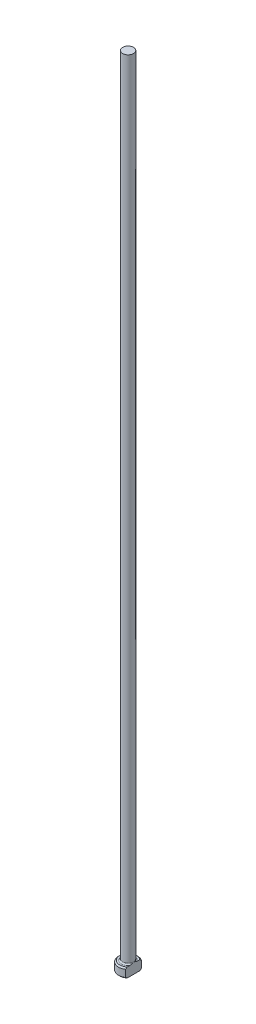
ISO-10303-21;
HEADER;
FILE_DESCRIPTION(('STEP AP214'),'2;1');
FILE_NAME('part.step','',(''),(''),'','','');
FILE_SCHEMA(('AUTOMOTIVE_DESIGN { 1 0 10303 214 1 1 1 1 }'));
ENDSEC;
DATA;
#1=APPLICATION_CONTEXT('core data for automotive mechanical design processes');
#2=APPLICATION_PROTOCOL_DEFINITION('international standard','automotive_design',2000,#1);
#3=PRODUCT_CONTEXT('',#1,'mechanical');
#4=PRODUCT('Part','Part','',(#3));
#5=PRODUCT_RELATED_PRODUCT_CATEGORY('part','',(#4));
#6=PRODUCT_DEFINITION_FORMATION('','',#4);
#7=PRODUCT_DEFINITION_CONTEXT('part definition',#1,'design');
#8=PRODUCT_DEFINITION('design','',#6,#7);
#9=PRODUCT_DEFINITION_SHAPE('','',#8);
#10=(LENGTH_UNIT() NAMED_UNIT(*) SI_UNIT(.MILLI.,.METRE.));
#11=(NAMED_UNIT(*) PLANE_ANGLE_UNIT() SI_UNIT($,.RADIAN.));
#12=(NAMED_UNIT(*) SI_UNIT($,.STERADIAN.) SOLID_ANGLE_UNIT());
#13=UNCERTAINTY_MEASURE_WITH_UNIT(LENGTH_MEASURE(1.E-05),#10,'distance_accuracy_value','');
#14=(GEOMETRIC_REPRESENTATION_CONTEXT(3) GLOBAL_UNCERTAINTY_ASSIGNED_CONTEXT((#13)) GLOBAL_UNIT_ASSIGNED_CONTEXT((#10,
#11,#12)) REPRESENTATION_CONTEXT('',''));
#15=CARTESIAN_POINT('',(0.,0.,0.));
#16=DIRECTION('',(0.,0.,1.));
#17=DIRECTION('',(1.,0.,0.));
#18=AXIS2_PLACEMENT_3D('',#15,#16,#17);
#19=CARTESIAN_POINT('',(0.,0.,0.));
#20=DIRECTION('',(0.,-1.,0.));
#21=DIRECTION('',(0.,0.,-1.));
#22=AXIS2_PLACEMENT_3D('',#19,#20,#21);
#23=PLANE('',#22);
#24=CARTESIAN_POINT('',(0.,0.,0.));
#25=DIRECTION('',(0.,-1.,0.));
#26=DIRECTION('',(0.,0.,-1.));
#27=AXIS2_PLACEMENT_3D('',#24,#25,#26);
#28=CIRCLE('',#27,1.29999999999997);
#29=CARTESIAN_POINT('',(0.849999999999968,0.,0.983615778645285));
#30=VERTEX_POINT('',#29);
#31=CARTESIAN_POINT('',(0.849999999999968,0.,-0.983615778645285));
#32=VERTEX_POINT('',#31);
#33=EDGE_CURVE('E98',#30,#32,#28,.T.);
#34=ORIENTED_EDGE('',*,*,#33,.T.);
#35=DIRECTION('',(0.,0.,1.));
#36=VECTOR('',#35,1.);
#37=CARTESIAN_POINT('',(0.849999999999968,0.,-1.23592070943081));
#38=LINE('',#37,#36);
#39=EDGE_CURVE('E83',#32,#30,#38,.T.);
#40=ORIENTED_EDGE('',*,*,#39,.T.);
#41=EDGE_LOOP('',(#34,#40));
#42=FACE_BOUND('',#41,.T.);
#43=ADVANCED_FACE('F32',(#42),#23,.T.);
#44=CARTESIAN_POINT('',(0.,259.958771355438,0.));
#45=DIRECTION('',(0.,1.,0.));
#46=DIRECTION('',(0.,0.,1.));
#47=AXIS2_PLACEMENT_3D('',#44,#45,#46);
#48=CYLINDRICAL_SURFACE('',#47,1.49999999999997);
#49=CARTESIAN_POINT('',(0.,1.29999999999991,0.));
#50=DIRECTION('',(0.,1.,0.));
#51=DIRECTION('',(0.,0.,1.));
#52=AXIS2_PLACEMENT_3D('',#49,#50,#51);
#53=CIRCLE('',#52,1.49999999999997);
#54=CARTESIAN_POINT('',(0.849999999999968,1.29999999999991,1.23592070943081));
#55=VERTEX_POINT('',#54);
#56=CARTESIAN_POINT('',(0.849999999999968,1.29999999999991,-1.23592070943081));
#57=VERTEX_POINT('',#56);
#58=EDGE_CURVE('E104',#55,#57,#53,.F.);
#59=ORIENTED_EDGE('',*,*,#58,.T.);
#60=DIRECTION('',(0.,-1.,0.));
#61=VECTOR('',#60,1.);
#62=CARTESIAN_POINT('',(0.849999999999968,125.,-1.23592070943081));
#63=LINE('',#62,#61);
#64=CARTESIAN_POINT('',(0.849999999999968,0.200000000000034,-1.23592070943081));
#65=VERTEX_POINT('',#64);
#66=EDGE_CURVE('E183',#57,#65,#63,.T.);
#67=ORIENTED_EDGE('',*,*,#66,.T.);
#68=CARTESIAN_POINT('',(0.,0.200000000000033,0.));
#69=DIRECTION('',(0.,-1.,0.));
#70=DIRECTION('',(0.,0.,-1.));
#71=AXIS2_PLACEMENT_3D('',#68,#69,#70);
#72=CIRCLE('',#71,1.49999999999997);
#73=CARTESIAN_POINT('',(0.849999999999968,0.200000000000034,1.23592070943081));
#74=VERTEX_POINT('',#73);
#75=EDGE_CURVE('E100',#65,#74,#72,.F.);
#76=ORIENTED_EDGE('',*,*,#75,.T.);
#77=DIRECTION('',(0.,-1.,0.));
#78=VECTOR('',#77,1.);
#79=CARTESIAN_POINT('',(0.849999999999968,125.,1.23592070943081));
#80=LINE('',#79,#78);
#81=EDGE_CURVE('E93',#55,#74,#80,.T.);
#82=ORIENTED_EDGE('',*,*,#81,.F.);
#83=EDGE_LOOP('',(#59,#67,#76,#82));
#84=FACE_BOUND('',#83,.T.);
#85=ADVANCED_FACE('F158',(#84),#48,.T.);
#86=CARTESIAN_POINT('',(-1.49999999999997,1.5,0.));
#87=DIRECTION('',(0.,1.,0.));
#88=DIRECTION('',(0.,0.,1.));
#89=AXIS2_PLACEMENT_3D('',#86,#87,#88);
#90=PLANE('',#89);
#91=CARTESIAN_POINT('',(0.,1.5,0.));
#92=DIRECTION('',(0.,1.,0.));
#93=DIRECTION('',(0.,0.,1.));
#94=AXIS2_PLACEMENT_3D('',#91,#92,#93);
#95=CIRCLE('',#94,1.29999999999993);
#96=CARTESIAN_POINT('',(0.849999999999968,1.5,-0.983615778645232));
#97=VERTEX_POINT('',#96);
#98=CARTESIAN_POINT('',(0.849999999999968,1.5,0.983615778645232));
#99=VERTEX_POINT('',#98);
#100=EDGE_CURVE('E178',#97,#99,#95,.T.);
#101=ORIENTED_EDGE('',*,*,#100,.T.);
#102=DIRECTION('',(0.,0.,-1.));
#103=VECTOR('',#102,1.);
#104=CARTESIAN_POINT('',(0.849999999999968,1.5,0.));
#105=LINE('',#104,#103);
#106=CARTESIAN_POINT('',(0.849999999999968,1.49999999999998,0.616441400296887));
#107=VERTEX_POINT('',#106);
#108=EDGE_CURVE('E57',#99,#107,#105,.T.);
#109=ORIENTED_EDGE('',*,*,#108,.T.);
#110=CARTESIAN_POINT('',(0.,1.5,0.));
#111=DIRECTION('',(0.,1.,0.));
#112=DIRECTION('',(0.,0.,1.));
#113=AXIS2_PLACEMENT_3D('',#110,#111,#112);
#114=CIRCLE('',#113,1.04999999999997);
#115=CARTESIAN_POINT('',(0.849999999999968,1.49999999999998,-0.616441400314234));
#116=VERTEX_POINT('',#115);
#117=EDGE_CURVE('E107',#107,#116,#114,.F.);
#118=ORIENTED_EDGE('',*,*,#117,.T.);
#119=EDGE_CURVE('E136',#116,#97,#105,.T.);
#120=ORIENTED_EDGE('',*,*,#119,.T.);
#121=EDGE_LOOP('',(#101,#109,#118,#120));
#122=FACE_BOUND('',#121,.T.);
#123=ADVANCED_FACE('F147',(#122),#90,.T.);
#124=CARTESIAN_POINT('',(0.,1.5,0.));
#125=DIRECTION('',(0.,-1.,0.));
#126=DIRECTION('',(0.,0.,-1.));
#127=AXIS2_PLACEMENT_3D('',#124,#125,#126);
#128=CONICAL_SURFACE('',#127,1.29999999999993,0.785398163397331);
#129=ORIENTED_EDGE('',*,*,#58,.F.);
#130=CARTESIAN_POINT('',(0.849999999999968,-0.0536064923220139,2.72407232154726));
#131=CARTESIAN_POINT('',(0.849999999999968,0.0399148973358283,2.62606654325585));
#132=CARTESIAN_POINT('',(0.849999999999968,0.133238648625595,2.52786853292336));
#133=CARTESIAN_POINT('',(0.849999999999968,0.319251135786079,2.33082073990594));
#134=CARTESIAN_POINT('',(0.849999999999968,0.411939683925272,2.23197078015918));
#135=CARTESIAN_POINT('',(0.849999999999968,0.597160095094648,2.03257664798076));
#136=CARTESIAN_POINT('',(0.849999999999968,0.689684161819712,1.93202522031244));
#137=CARTESIAN_POINT('',(0.849999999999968,0.873277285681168,1.72962471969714));
#138=CARTESIAN_POINT('',(0.849999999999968,0.964346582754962,1.62777586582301));
#139=CARTESIAN_POINT('',(0.849999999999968,1.10955880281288,1.46151679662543));
#140=CARTESIAN_POINT('',(0.849999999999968,1.16444529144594,1.39775756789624));
#141=CARTESIAN_POINT('',(0.849999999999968,1.27292840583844,1.26911422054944));
#142=CARTESIAN_POINT('',(0.849999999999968,1.32652466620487,1.20422979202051));
#143=CARTESIAN_POINT('',(0.849999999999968,1.43166568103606,1.07302339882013));
#144=CARTESIAN_POINT('',(0.849999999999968,1.48321432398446,1.00670456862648));
#145=CARTESIAN_POINT('',(0.849999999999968,1.58324559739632,0.871812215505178));
#146=CARTESIAN_POINT('',(0.849999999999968,1.63173001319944,0.803240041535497));
#147=CARTESIAN_POINT('',(0.849999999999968,1.71576170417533,0.674554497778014));
#148=CARTESIAN_POINT('',(0.849999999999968,1.75211002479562,0.614972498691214));
#149=CARTESIAN_POINT('',(0.849999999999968,1.81898270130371,0.492486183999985));
#150=CARTESIAN_POINT('',(0.849999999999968,1.84950605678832,0.429581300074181));
#151=CARTESIAN_POINT('',(0.849999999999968,1.89525543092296,0.31344348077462));
#152=CARTESIAN_POINT('',(0.849999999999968,1.91235250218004,0.260986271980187));
#153=CARTESIAN_POINT('',(0.849999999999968,1.93136611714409,0.180826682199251));
#154=CARTESIAN_POINT('',(0.849999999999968,1.93659539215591,0.153907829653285));
#155=CARTESIAN_POINT('',(0.849999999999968,1.94459007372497,0.0997127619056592));
#156=CARTESIAN_POINT('',(0.849999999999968,1.94735676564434,0.0724367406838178));
#157=CARTESIAN_POINT('',(0.849999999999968,1.95026529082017,0.0175115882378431));
#158=CARTESIAN_POINT('',(0.849999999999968,1.95038485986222,-0.0101387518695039));
#159=CARTESIAN_POINT('',(0.849999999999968,1.94794150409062,-0.0653143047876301));
#160=CARTESIAN_POINT('',(0.849999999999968,1.94537851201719,-0.0928395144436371));
#161=CARTESIAN_POINT('',(0.849999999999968,1.93385723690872,-0.175030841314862));
#162=CARTESIAN_POINT('',(0.849999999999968,1.92106065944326,-0.229178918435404));
#163=CARTESIAN_POINT('',(0.849999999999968,1.89152127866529,-0.323067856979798));
#164=CARTESIAN_POINT('',(0.849999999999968,1.87629794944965,-0.363325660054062));
#165=CARTESIAN_POINT('',(0.849999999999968,1.84242832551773,-0.442398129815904));
#166=CARTESIAN_POINT('',(0.849999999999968,1.82377936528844,-0.481211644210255));
#167=CARTESIAN_POINT('',(0.849999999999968,1.78377495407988,-0.557941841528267));
#168=CARTESIAN_POINT('',(0.849999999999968,1.76239176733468,-0.59584379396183));
#169=CARTESIAN_POINT('',(0.849999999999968,1.71778219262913,-0.67051414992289));
#170=CARTESIAN_POINT('',(0.849999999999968,1.69455659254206,-0.707283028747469));
#171=CARTESIAN_POINT('',(0.849999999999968,1.63863584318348,-0.792218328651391));
#172=CARTESIAN_POINT('',(0.849999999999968,1.60539843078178,-0.840025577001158));
#173=CARTESIAN_POINT('',(0.849999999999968,1.53723101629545,-0.934423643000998));
#174=CARTESIAN_POINT('',(0.849999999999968,1.50230057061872,-0.981014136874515));
#175=CARTESIAN_POINT('',(0.849999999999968,1.43120159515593,-1.07330100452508));
#176=CARTESIAN_POINT('',(0.849999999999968,1.39503201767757,-1.11899656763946));
#177=CARTESIAN_POINT('',(0.849999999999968,1.32179772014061,-1.20966630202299));
#178=CARTESIAN_POINT('',(0.849999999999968,1.28473294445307,-1.25464042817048));
#179=CARTESIAN_POINT('',(0.849999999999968,1.17226420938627,-1.38904939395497));
#180=CARTESIAN_POINT('',(0.849999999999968,1.09584896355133,-1.47763652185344));
#181=CARTESIAN_POINT('',(0.849999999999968,0.941436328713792,-1.65332756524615));
#182=CARTESIAN_POINT('',(0.849999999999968,0.863439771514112,-1.74043221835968));
#183=CARTESIAN_POINT('',(0.849999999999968,0.715932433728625,-1.90311943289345));
#184=CARTESIAN_POINT('',(0.849999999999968,0.646544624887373,-1.97881368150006));
#185=CARTESIAN_POINT('',(0.849999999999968,0.507159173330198,-2.12965926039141));
#186=CARTESIAN_POINT('',(0.849999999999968,0.437161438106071,-2.20481050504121));
#187=CARTESIAN_POINT('',(0.849999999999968,0.297217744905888,-2.3541659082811));
#188=CARTESIAN_POINT('',(0.849999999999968,0.227274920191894,-2.42837300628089));
#189=CARTESIAN_POINT('',(0.849999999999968,0.0870600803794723,-2.57645011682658));
#190=CARTESIAN_POINT('',(0.849999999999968,0.0167881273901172,-2.65032018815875));
#191=CARTESIAN_POINT('',(0.849999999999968,-0.0536064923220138,-2.72407232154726));
#192=B_SPLINE_CURVE_WITH_KNOTS('',3,(#130,#131,#132,#133,#134,#135,#136,#137,#138,#139,#140,
#141,#142,#143,#144,#145,#146,#147,#148,#149,#150,#151,#152,#153,#154,#155,#156,#157,#158,#159,
#160,#161,#162,#163,#164,#165,#166,#167,#168,#169,#170,#171,#172,#173,#174,#175,#176,#177,#178,
#179,#180,#181,#182,#183,#184,#185,#186,#187,#188,#189,#190,#191),.UNSPECIFIED.,.F.,.F.,(4,2,2,
2,2,2,2,2,2,2,2,2,2,2,2,2,2,2,2,2,2,2,2,2,2,2,2,2,2,2,4),(0.,0.406405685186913,
0.812926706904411,1.2228482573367,1.63270148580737,1.88507867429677,2.13752651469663,
2.3894694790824,2.6412642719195,2.85046439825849,3.05970042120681,3.22459093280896,
3.30675945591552,3.38888506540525,3.47170115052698,3.55451931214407,3.72055062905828,
3.84950358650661,3.97855731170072,4.10904305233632,4.2394732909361,4.41409453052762,
4.58876177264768,4.76358052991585,4.93841017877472,5.28934513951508,5.64010005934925,
5.94815166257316,6.25625083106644,6.56217157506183,6.8680367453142),.UNSPECIFIED.);
#193=EDGE_CURVE('E135',#55,#99,#192,.T.);
#194=ORIENTED_EDGE('',*,*,#193,.T.);
#195=ORIENTED_EDGE('',*,*,#100,.F.);
#196=EDGE_CURVE('E127',#97,#57,#192,.T.);
#197=ORIENTED_EDGE('',*,*,#196,.T.);
#198=EDGE_LOOP('',(#129,#194,#195,#197));
#199=FACE_BOUND('',#198,.T.);
#200=ADVANCED_FACE('F143',(#199),#128,.T.);
#201=CARTESIAN_POINT('',(0.,0.200000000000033,0.));
#202=DIRECTION('',(0.,1.,0.));
#203=DIRECTION('',(0.,0.,1.));
#204=AXIS2_PLACEMENT_3D('',#201,#202,#203);
#205=CONICAL_SURFACE('',#204,1.49999999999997,0.785398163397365);
#206=ORIENTED_EDGE('',*,*,#75,.F.);
#207=CARTESIAN_POINT('',(0.849999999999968,1.55360649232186,-2.72407232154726));
#208=CARTESIAN_POINT('',(0.849999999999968,1.46008510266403,-2.62606654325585));
#209=CARTESIAN_POINT('',(0.849999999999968,1.36676135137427,-2.52786853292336));
#210=CARTESIAN_POINT('',(0.849999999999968,1.1807488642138,-2.33082073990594));
#211=CARTESIAN_POINT('',(0.849999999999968,1.08806031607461,-2.23197078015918));
#212=CARTESIAN_POINT('',(0.849999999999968,0.902839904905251,-2.03257664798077));
#213=CARTESIAN_POINT('',(0.849999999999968,0.810315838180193,-1.93202522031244));
#214=CARTESIAN_POINT('',(0.849999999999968,0.626722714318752,-1.72962471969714));
#215=CARTESIAN_POINT('',(0.849999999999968,0.535653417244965,-1.62777586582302));
#216=CARTESIAN_POINT('',(0.849999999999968,0.390441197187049,-1.46151679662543));
#217=CARTESIAN_POINT('',(0.849999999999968,0.335554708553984,-1.39775756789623));
#218=CARTESIAN_POINT('',(0.849999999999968,0.227071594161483,-1.26911422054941));
#219=CARTESIAN_POINT('',(0.849999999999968,0.173475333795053,-1.20422979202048));
#220=CARTESIAN_POINT('',(0.849999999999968,0.0683343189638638,-1.07302339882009));
#221=CARTESIAN_POINT('',(0.849999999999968,0.0167856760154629,-1.00670456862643));
#222=CARTESIAN_POINT('',(0.849999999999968,-0.0832455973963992,-0.871812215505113));
#223=CARTESIAN_POINT('',(0.849999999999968,-0.131730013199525,-0.803240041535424));
#224=CARTESIAN_POINT('',(0.849999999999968,-0.215761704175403,-0.674554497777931));
#225=CARTESIAN_POINT('',(0.849999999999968,-0.252110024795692,-0.614972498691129));
#226=CARTESIAN_POINT('',(0.849999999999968,-0.318982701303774,-0.492486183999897));
#227=CARTESIAN_POINT('',(0.849999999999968,-0.349506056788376,-0.429581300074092));
#228=CARTESIAN_POINT('',(0.849999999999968,-0.395255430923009,-0.313443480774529));
#229=CARTESIAN_POINT('',(0.849999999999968,-0.412352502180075,-0.260986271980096));
#230=CARTESIAN_POINT('',(0.849999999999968,-0.431366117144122,-0.180826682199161));
#231=CARTESIAN_POINT('',(0.849999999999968,-0.436595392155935,-0.153907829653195));
#232=CARTESIAN_POINT('',(0.849999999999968,-0.444590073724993,-0.09971276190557));
#233=CARTESIAN_POINT('',(0.849999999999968,-0.44735676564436,-0.0724367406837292));
#234=CARTESIAN_POINT('',(0.849999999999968,-0.450265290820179,-0.0175115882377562));
#235=CARTESIAN_POINT('',(0.849999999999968,-0.450384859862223,0.0101387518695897));
#236=CARTESIAN_POINT('',(0.849999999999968,-0.447941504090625,0.0653143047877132));
#237=CARTESIAN_POINT('',(0.849999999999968,-0.445378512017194,0.0928395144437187));
#238=CARTESIAN_POINT('',(0.849999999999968,-0.433857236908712,0.175030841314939));
#239=CARTESIAN_POINT('',(0.849999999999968,-0.421060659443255,0.229178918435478));
#240=CARTESIAN_POINT('',(0.849999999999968,-0.391521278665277,0.323067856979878));
#241=CARTESIAN_POINT('',(0.849999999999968,-0.376297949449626,0.36332566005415));
#242=CARTESIAN_POINT('',(0.849999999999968,-0.3424283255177,0.442398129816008));
#243=CARTESIAN_POINT('',(0.849999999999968,-0.323779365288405,0.481211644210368));
#244=CARTESIAN_POINT('',(0.849999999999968,-0.283774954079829,0.557941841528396));
#245=CARTESIAN_POINT('',(0.849999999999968,-0.262391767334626,0.595843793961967));
#246=CARTESIAN_POINT('',(0.849999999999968,-0.217782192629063,0.670514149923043));
#247=CARTESIAN_POINT('',(0.849999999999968,-0.194556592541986,0.70728302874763));
#248=CARTESIAN_POINT('',(0.849999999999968,-0.1386358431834,0.792218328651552));
#249=CARTESIAN_POINT('',(0.849999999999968,-0.105398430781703,0.840025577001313));
#250=CARTESIAN_POINT('',(0.849999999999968,-0.0372310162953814,0.934423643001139));
#251=CARTESIAN_POINT('',(0.849999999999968,-0.00230057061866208,0.98101413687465));
#252=CARTESIAN_POINT('',(0.849999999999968,0.0687984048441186,1.07330100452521));
#253=CARTESIAN_POINT('',(0.849999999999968,0.104967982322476,1.11899656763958));
#254=CARTESIAN_POINT('',(0.849999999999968,0.178202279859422,1.20966630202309));
#255=CARTESIAN_POINT('',(0.849999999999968,0.215267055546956,1.25464042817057));
#256=CARTESIAN_POINT('',(0.849999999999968,0.327735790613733,1.38904939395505));
#257=CARTESIAN_POINT('',(0.849999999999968,0.40415103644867,1.47763652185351));
#258=CARTESIAN_POINT('',(0.849999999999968,0.558563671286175,1.6533275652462));
#259=CARTESIAN_POINT('',(0.849999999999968,0.636560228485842,1.74043221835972));
#260=CARTESIAN_POINT('',(0.849999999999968,0.784067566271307,1.90311943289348));
#261=CARTESIAN_POINT('',(0.849999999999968,0.853455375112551,1.97881368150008));
#262=CARTESIAN_POINT('',(0.849999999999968,0.992840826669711,2.12965926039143));
#263=CARTESIAN_POINT('',(0.849999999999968,1.06283856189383,2.20481050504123));
#264=CARTESIAN_POINT('',(0.849999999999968,1.202782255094,2.35416590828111));
#265=CARTESIAN_POINT('',(0.849999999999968,1.27272507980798,2.42837300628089));
#266=CARTESIAN_POINT('',(0.849999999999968,1.41293991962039,2.57645011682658));
#267=CARTESIAN_POINT('',(0.849999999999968,1.48321187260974,2.65032018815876));
#268=CARTESIAN_POINT('',(0.849999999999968,1.55360649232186,2.72407232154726));
#269=B_SPLINE_CURVE_WITH_KNOTS('',3,(#207,#208,#209,#210,#211,#212,#213,#214,#215,#216,#217,
#218,#219,#220,#221,#222,#223,#224,#225,#226,#227,#228,#229,#230,#231,#232,#233,#234,#235,#236,
#237,#238,#239,#240,#241,#242,#243,#244,#245,#246,#247,#248,#249,#250,#251,#252,#253,#254,#255,
#256,#257,#258,#259,#260,#261,#262,#263,#264,#265,#266,#267,#268),.UNSPECIFIED.,.F.,.F.,(4,2,2,
2,2,2,2,2,2,2,2,2,2,2,2,2,2,2,2,2,2,2,2,2,2,2,2,2,2,2,4),(0.,0.406405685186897,
0.812926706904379,1.22284825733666,1.63270148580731,1.88507867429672,2.13752651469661,
2.3894694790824,2.64126427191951,2.85046439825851,3.05970042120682,3.22459093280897,
3.30675945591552,3.38888506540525,3.47170115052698,3.55451931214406,3.72055062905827,
3.84950358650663,3.97855731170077,4.10904305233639,4.23947329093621,4.4140945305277,
4.58876177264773,4.76358052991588,4.93841017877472,5.28934513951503,5.64010005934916,
5.94815166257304,6.2562508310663,6.56217157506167,6.86803674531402),.UNSPECIFIED.);
#270=EDGE_CURVE('E86',#65,#32,#269,.T.);
#271=ORIENTED_EDGE('',*,*,#270,.T.);
#272=ORIENTED_EDGE('',*,*,#33,.F.);
#273=EDGE_CURVE('E89',#30,#74,#269,.T.);
#274=ORIENTED_EDGE('',*,*,#273,.T.);
#275=EDGE_LOOP('',(#206,#271,#272,#274));
#276=FACE_BOUND('',#275,.T.);
#277=ADVANCED_FACE('F97',(#276),#205,.T.);
#278=CARTESIAN_POINT('',(0.,1.69999999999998,0.));
#279=DIRECTION('',(0.,1.,0.));
#280=DIRECTION('',(0.,0.,1.));
#281=AXIS2_PLACEMENT_3D('',#278,#279,#280);
#282=TOROIDAL_SURFACE('',#281,1.04999999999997,0.2);
#283=CARTESIAN_POINT('',(0.849999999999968,1.69999999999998,0.));
#284=CARTESIAN_POINT('',(0.849999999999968,1.70000051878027,-9.40181058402E-12));
#285=CARTESIAN_POINT('',(0.849999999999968,1.70000103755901,-8.53981725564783E-08));
#286=CARTESIAN_POINT('',(0.849999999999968,1.70000204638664,-3.68295676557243E-07));
#287=CARTESIAN_POINT('',(0.849999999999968,1.70000253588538,-5.67473109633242E-07));
#288=CARTESIAN_POINT('',(0.849999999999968,1.70000350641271,-1.05059094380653E-06));
#289=CARTESIAN_POINT('',(0.849999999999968,1.70000398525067,-1.33882692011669E-06));
#290=CARTESIAN_POINT('',(0.849999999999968,1.7000049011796,-1.96944630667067E-06));
#291=CARTESIAN_POINT('',(0.849999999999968,1.70000533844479,-2.31158620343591E-06));
#292=CARTESIAN_POINT('',(0.849999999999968,1.70000675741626,-3.51016254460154E-06));
#293=CARTESIAN_POINT('',(0.849999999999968,1.70000767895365,-4.43847621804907E-06));
#294=CARTESIAN_POINT('',(0.849999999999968,1.70000936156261,-6.38697155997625E-06));
#295=CARTESIAN_POINT('',(0.849999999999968,1.7000101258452,-7.40454028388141E-06));
#296=CARTESIAN_POINT('',(0.849999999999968,1.70001287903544,-1.12525915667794E-05));
#297=CARTESIAN_POINT('',(0.849999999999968,1.70001471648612,-1.41948048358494E-05));
#298=CARTESIAN_POINT('',(0.849999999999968,1.70001783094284,-2.00941117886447E-05));
#299=CARTESIAN_POINT('',(0.849999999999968,1.7000191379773,-2.30360250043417E-05));
#300=CARTESIAN_POINT('',(0.849999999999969,1.700024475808,-3.52043664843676E-05));
#301=CARTESIAN_POINT('',(0.849999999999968,1.70002838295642,-4.4479803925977E-05));
#302=CARTESIAN_POINT('',(0.849999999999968,1.70003486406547,-6.20583674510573E-05));
#303=CARTESIAN_POINT('',(0.849999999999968,1.70003754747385,-7.03197985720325E-05));
#304=CARTESIAN_POINT('',(0.849999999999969,1.70005819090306,-0.000128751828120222));
#305=CARTESIAN_POINT('',(0.849999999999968,1.70008371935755,-0.000175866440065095));
#306=CARTESIAN_POINT('',(0.849999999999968,1.70017804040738,-0.000356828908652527));
#307=CARTESIAN_POINT('',(0.849999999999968,1.70024121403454,-0.000492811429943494));
#308=CARTESIAN_POINT('',(0.849999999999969,1.70048655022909,-0.00101279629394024));
#309=CARTESIAN_POINT('',(0.849999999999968,1.70067459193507,-0.0013945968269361));
#310=CARTESIAN_POINT('',(0.849999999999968,1.7014276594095,-0.00293145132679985));
#311=CARTESIAN_POINT('',(0.849999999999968,1.70198609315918,-0.0040889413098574));
#312=CARTESIAN_POINT('',(0.849999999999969,1.71043533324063,-0.0215925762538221));
#313=CARTESIAN_POINT('',(0.849999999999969,1.71837727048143,-0.0379203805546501));
#314=CARTESIAN_POINT('',(0.849999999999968,1.7338686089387,-0.0700737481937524));
#315=CARTESIAN_POINT('',(0.849999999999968,1.74142215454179,-0.0858974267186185));
#316=CARTESIAN_POINT('',(0.849999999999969,1.75718253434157,-0.119339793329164));
#317=CARTESIAN_POINT('',(0.849999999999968,1.76537140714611,-0.136967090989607));
#318=CARTESIAN_POINT('',(0.849999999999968,1.78150993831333,-0.172531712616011));
#319=CARTESIAN_POINT('',(0.849999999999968,1.78945661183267,-0.190470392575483));
#320=CARTESIAN_POINT('',(0.849999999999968,1.80890508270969,-0.23585761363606));
#321=CARTESIAN_POINT('',(0.849999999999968,1.8201219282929,-0.263430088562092));
#322=CARTESIAN_POINT('',(0.849999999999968,1.84085119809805,-0.31855841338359));
#323=CARTESIAN_POINT('',(0.849999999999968,1.85039454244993,-0.346102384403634));
#324=CARTESIAN_POINT('',(0.849999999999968,1.86376741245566,-0.389594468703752));
#325=CARTESIAN_POINT('',(0.849999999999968,1.86826823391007,-0.405334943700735));
#326=CARTESIAN_POINT('',(0.849999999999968,1.87655535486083,-0.437077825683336));
#327=CARTESIAN_POINT('',(0.849999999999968,1.8803382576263,-0.453081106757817));
#328=CARTESIAN_POINT('',(0.849999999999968,1.8907100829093,-0.502906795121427));
#329=CARTESIAN_POINT('',(0.849999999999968,1.89584064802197,-0.537068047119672));
#330=CARTESIAN_POINT('',(0.849999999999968,1.90023986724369,-0.59774723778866));
#331=CARTESIAN_POINT('',(0.849999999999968,1.90059986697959,-0.624181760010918));
#332=CARTESIAN_POINT('',(0.849999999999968,1.89734237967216,-0.676523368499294));
#333=CARTESIAN_POINT('',(0.849999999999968,1.89377863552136,-0.702432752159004));
#334=CARTESIAN_POINT('',(0.849999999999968,1.88404638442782,-0.743149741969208));
#335=CARTESIAN_POINT('',(0.849999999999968,1.87944517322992,-0.758330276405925));
#336=CARTESIAN_POINT('',(0.849999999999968,1.86810073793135,-0.787921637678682));
#337=CARTESIAN_POINT('',(0.849999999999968,1.86135499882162,-0.802331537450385));
#338=CARTESIAN_POINT('',(0.849999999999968,1.84721190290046,-0.826746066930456));
#339=CARTESIAN_POINT('',(0.849999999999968,1.84028561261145,-0.837021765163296));
#340=CARTESIAN_POINT('',(0.849999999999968,1.82488560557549,-0.856339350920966));
#341=CARTESIAN_POINT('',(0.849999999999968,1.8164148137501,-0.86538351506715));
#342=CARTESIAN_POINT('',(0.849999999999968,1.79993436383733,-0.879978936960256));
#343=CARTESIAN_POINT('',(0.849999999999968,1.79222027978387,-0.885862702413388));
#344=CARTESIAN_POINT('',(0.849999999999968,1.77592760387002,-0.896293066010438));
#345=CARTESIAN_POINT('',(0.849999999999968,1.76734935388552,-0.900840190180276));
#346=CARTESIAN_POINT('',(0.849999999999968,1.74943887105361,-0.908347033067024));
#347=CARTESIAN_POINT('',(0.849999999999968,1.74010143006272,-0.911294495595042));
#348=CARTESIAN_POINT('',(0.849999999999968,1.7210315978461,-0.91532157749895));
#349=CARTESIAN_POINT('',(0.849999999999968,1.71129950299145,-0.916402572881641));
#350=CARTESIAN_POINT('',(0.849999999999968,1.69303591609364,-0.916598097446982));
#351=CARTESIAN_POINT('',(0.849999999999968,1.68450611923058,-0.915941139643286));
#352=CARTESIAN_POINT('',(0.849999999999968,1.667687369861,-0.913176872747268));
#353=CARTESIAN_POINT('',(0.849999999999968,1.65939839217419,-0.911069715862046));
#354=CARTESIAN_POINT('',(0.849999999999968,1.64340816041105,-0.905576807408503));
#355=CARTESIAN_POINT('',(0.849999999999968,1.63569966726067,-0.902211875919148));
#356=CARTESIAN_POINT('',(0.849999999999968,1.62087356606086,-0.894372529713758));
#357=CARTESIAN_POINT('',(0.849999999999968,1.61375616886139,-0.889897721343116));
#358=CARTESIAN_POINT('',(0.849999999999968,1.59761508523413,-0.87813790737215));
#359=CARTESIAN_POINT('',(0.849999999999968,1.58889769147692,-0.870431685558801));
#360=CARTESIAN_POINT('',(0.849999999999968,1.5728293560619,-0.853701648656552));
#361=CARTESIAN_POINT('',(0.849999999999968,1.56548157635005,-0.84467486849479));
#362=CARTESIAN_POINT('',(0.849999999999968,1.54959009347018,-0.822072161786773));
#363=CARTESIAN_POINT('',(0.849999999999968,1.5416531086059,-0.808071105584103));
#364=CARTESIAN_POINT('',(0.849999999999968,1.52810899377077,-0.77903495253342));
#365=CARTESIAN_POINT('',(0.849999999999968,1.52250055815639,-0.764000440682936));
#366=CARTESIAN_POINT('',(0.849999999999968,1.51092301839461,-0.725431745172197));
#367=CARTESIAN_POINT('',(0.849999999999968,1.50625689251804,-0.7015093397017));
#368=CARTESIAN_POINT('',(0.849999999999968,1.50057784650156,-0.65298680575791));
#369=CARTESIAN_POINT('',(0.849999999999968,1.49961383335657,-0.628381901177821));
#370=CARTESIAN_POINT('',(0.849999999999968,1.50106390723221,-0.560102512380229));
#371=CARTESIAN_POINT('',(0.849999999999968,1.50669397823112,-0.516501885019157));
#372=CARTESIAN_POINT('',(0.849999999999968,1.51953102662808,-0.453258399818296));
#373=CARTESIAN_POINT('',(0.849999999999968,1.52436540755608,-0.433034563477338));
#374=CARTESIAN_POINT('',(0.849999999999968,1.53515534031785,-0.393001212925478));
#375=CARTESIAN_POINT('',(0.849999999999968,1.54110441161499,-0.373190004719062));
#376=CARTESIAN_POINT('',(0.849999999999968,1.55603600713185,-0.327373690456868));
#377=CARTESIAN_POINT('',(0.849999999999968,1.56537124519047,-0.301485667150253));
#378=CARTESIAN_POINT('',(0.849999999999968,1.58544986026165,-0.249610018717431));
#379=CARTESIAN_POINT('',(0.849999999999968,1.59621976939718,-0.2236328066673));
#380=CARTESIAN_POINT('',(0.849999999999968,1.61482171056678,-0.180777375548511));
#381=CARTESIAN_POINT('',(0.849999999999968,1.62241504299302,-0.163793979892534));
#382=CARTESIAN_POINT('',(0.849999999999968,1.63780310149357,-0.130109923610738));
#383=CARTESIAN_POINT('',(0.849999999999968,1.64559528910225,-0.113408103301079));
#384=CARTESIAN_POINT('',(0.849999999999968,1.66057370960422,-0.0817127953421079));
#385=CARTESIAN_POINT('',(0.849999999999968,1.66774468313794,-0.0667119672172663));
#386=CARTESIAN_POINT('',(0.849999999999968,1.68244267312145,-0.0362276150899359));
#387=CARTESIAN_POINT('',(0.849999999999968,1.68997332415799,-0.020745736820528));
#388=CARTESIAN_POINT('',(0.849999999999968,1.69801386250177,-0.00408905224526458));
#389=CARTESIAN_POINT('',(0.849999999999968,1.69857223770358,-0.00293166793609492));
#390=CARTESIAN_POINT('',(0.849999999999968,1.69932528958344,-0.00139484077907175));
#391=CARTESIAN_POINT('',(0.849999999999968,1.69951337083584,-0.00101296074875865));
#392=CARTESIAN_POINT('',(0.849999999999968,1.69975875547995,-0.000492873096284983));
#393=CARTESIAN_POINT('',(0.849999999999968,1.69982193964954,-0.000356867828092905));
#394=CARTESIAN_POINT('',(0.849999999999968,1.6999162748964,-0.000175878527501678));
#395=CARTESIAN_POINT('',(0.849999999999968,1.6999418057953,-0.000128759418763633));
#396=CARTESIAN_POINT('',(0.849999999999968,1.69996245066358,-7.03220999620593E-05));
#397=CARTESIAN_POINT('',(0.849999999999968,1.69996513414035,-6.20602802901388E-05));
#398=CARTESIAN_POINT('',(0.849999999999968,1.69997161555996,-4.44808855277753E-05));
#399=CARTESIAN_POINT('',(0.849999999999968,1.69997552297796,-3.52050155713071E-05));
#400=CARTESIAN_POINT('',(0.849999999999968,1.6999808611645,-2.30361869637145E-05));
#401=CARTESIAN_POINT('',(0.849999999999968,1.69998216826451,-2.00942075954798E-05));
#402=CARTESIAN_POINT('',(0.849999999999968,1.69998528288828,-1.41947798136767E-05));
#403=CARTESIAN_POINT('',(0.849999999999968,1.69998712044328,-1.12525137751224E-05));
#404=CARTESIAN_POINT('',(0.849999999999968,1.6999898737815,-7.40441477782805E-06));
#405=CARTESIAN_POINT('',(0.849999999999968,1.69999063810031,-6.38684057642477E-06));
#406=CARTESIAN_POINT('',(0.849999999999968,1.69999232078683,-4.4383417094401E-06));
#407=CARTESIAN_POINT('',(0.849999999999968,1.69999324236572,-3.51003022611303E-06));
#408=CARTESIAN_POINT('',(0.849999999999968,1.69999466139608,-2.3114658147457E-06));
#409=CARTESIAN_POINT('',(0.849999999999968,1.69999509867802,-1.96933111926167E-06));
#410=CARTESIAN_POINT('',(0.849999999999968,1.69999601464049,-1.338725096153E-06));
#411=CARTESIAN_POINT('',(0.849999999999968,1.69999649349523,-1.05049730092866E-06));
#412=CARTESIAN_POINT('',(0.849999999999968,1.69999746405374,-5.67399370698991E-07));
#413=CARTESIAN_POINT('',(0.849999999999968,1.69999795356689,-3.68233376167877E-07));
#414=CARTESIAN_POINT('',(0.849999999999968,1.69999896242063,-8.53633970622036E-08));
#415=CARTESIAN_POINT('',(0.849999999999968,1.69999948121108,9.40196651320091E-12));
#416=CARTESIAN_POINT('',(0.849999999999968,1.69999999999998,0.));
#417=B_SPLINE_CURVE_WITH_KNOTS('',3,(#283,#284,#285,#286,#287,#288,#289,#290,#291,#292,#293,
#294,#295,#296,#297,#298,#299,#300,#301,#302,#303,#304,#305,#306,#307,#308,#309,#310,#311,#312,
#313,#314,#315,#316,#317,#318,#319,#320,#321,#322,#323,#324,#325,#326,#327,#328,#329,#330,#331,
#332,#333,#334,#335,#336,#337,#338,#339,#340,#341,#342,#343,#344,#345,#346,#347,#348,#349,#350,
#351,#352,#353,#354,#355,#356,#357,#358,#359,#360,#361,#362,#363,#364,#365,#366,#367,#368,#369,
#370,#371,#372,#373,#374,#375,#376,#377,#378,#379,#380,#381,#382,#383,#384,#385,#386,#387,#388,
#389,#390,#391,#392,#393,#394,#395,#396,#397,#398,#399,#400,#401,#402,#403,#404,#405,#406,#407,
#408,#409,#410,#411,#412,#413,#414,#415,#416),.UNSPECIFIED.,.T.,.F.,(4,2,2,2,2,2,2,2,2,2,2,2,2,
2,2,2,2,2,2,2,2,2,2,2,2,2,2,2,2,2,2,2,2,2,2,2,2,2,2,2,2,2,2,2,2,2,2,2,2,2,2,2,2,2,2,2,2,2,2,2,2,
2,2,2,2,2,4),(0.,1.55468737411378E-06,3.13278180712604E-06,4.80367222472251E-06,
6.46722002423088E-06,1.03719688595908E-05,1.41866502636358E-05,2.45537684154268E-05,
3.42019719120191E-05,6.43851505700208E-05,9.04176825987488E-05,0.000250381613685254,
0.00070083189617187,0.00197684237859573,0.0058331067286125,0.060296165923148,0.112899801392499,
0.171206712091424,0.230063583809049,0.319335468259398,0.406727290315,0.455824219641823,
0.505147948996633,0.608437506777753,0.687539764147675,0.765571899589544,0.81303553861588,
0.860555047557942,0.897604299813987,0.934584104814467,0.96357666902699,0.992557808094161,
1.02175796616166,1.05093658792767,1.0764748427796,1.10201041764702,1.12714077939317,
1.15228006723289,1.18699327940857,1.2217856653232,1.26980034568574,1.31778806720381,
1.39050031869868,1.4641699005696,1.59521965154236,1.65759205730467,1.71961250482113,
1.80213235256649,1.8864735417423,1.94228209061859,1.99757019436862,2.047451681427,
2.09909333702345,2.10294924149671,2.10422551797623,2.10467604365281,2.10483602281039,
2.10486205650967,2.10489224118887,2.10490188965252,2.10491225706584,2.10491607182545,
2.10491997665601,2.10492164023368,2.10492331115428,2.10492488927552,2.10492644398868),.UNSPECIFIED.);
#418=CARTESIAN_POINT('',(0.849999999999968,1.69999999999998,0.));
#419=VERTEX_POINT('',#418);
#420=EDGE_CURVE('E11',#116,#419,#417,.T.);
#421=ORIENTED_EDGE('',*,*,#420,.F.);
#422=ORIENTED_EDGE('',*,*,#117,.F.);
#423=CARTESIAN_POINT('',(0.849999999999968,1.69999999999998,0.));
#424=CARTESIAN_POINT('',(0.849999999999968,1.69999948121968,9.40181404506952E-12));
#425=CARTESIAN_POINT('',(0.849999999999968,1.69999896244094,8.53981725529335E-08));
#426=CARTESIAN_POINT('',(0.849999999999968,1.69999795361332,3.68295676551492E-07));
#427=CARTESIAN_POINT('',(0.849999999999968,1.69999746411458,5.67473109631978E-07));
#428=CARTESIAN_POINT('',(0.849999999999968,1.69999649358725,1.05059094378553E-06));
#429=CARTESIAN_POINT('',(0.849999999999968,1.69999601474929,1.33882692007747E-06));
#430=CARTESIAN_POINT('',(0.849999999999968,1.69999509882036,1.96944630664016E-06));
#431=CARTESIAN_POINT('',(0.849999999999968,1.69999466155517,2.31158620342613E-06));
#432=CARTESIAN_POINT('',(0.849999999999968,1.6999932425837,3.51016254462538E-06));
#433=CARTESIAN_POINT('',(0.849999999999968,1.6999923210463,4.43847621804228E-06));
#434=CARTESIAN_POINT('',(0.849999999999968,1.69999063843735,6.38697155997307E-06));
#435=CARTESIAN_POINT('',(0.849999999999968,1.69998987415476,7.4045402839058E-06));
#436=CARTESIAN_POINT('',(0.849999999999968,1.69998712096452,1.12525915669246E-05));
#437=CARTESIAN_POINT('',(0.849999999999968,1.69998528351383,1.41948048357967E-05));
#438=CARTESIAN_POINT('',(0.849999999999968,1.69998216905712,2.0094111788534E-05));
#439=CARTESIAN_POINT('',(0.849999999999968,1.69998086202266,2.30360250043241E-05));
#440=CARTESIAN_POINT('',(0.849999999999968,1.69997552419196,3.52043664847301E-05));
#441=CARTESIAN_POINT('',(0.849999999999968,1.69997161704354,4.44798039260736E-05));
#442=CARTESIAN_POINT('',(0.849999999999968,1.69996513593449,6.20583674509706E-05));
#443=CARTESIAN_POINT('',(0.849999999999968,1.69996245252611,7.03197985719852E-05));
#444=CARTESIAN_POINT('',(0.849999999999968,1.6999418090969,0.000128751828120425));
#445=CARTESIAN_POINT('',(0.849999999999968,1.69991628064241,0.000175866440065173));
#446=CARTESIAN_POINT('',(0.849999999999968,1.69982195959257,0.000356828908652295));
#447=CARTESIAN_POINT('',(0.849999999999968,1.69975878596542,0.000492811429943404));
#448=CARTESIAN_POINT('',(0.849999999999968,1.69951344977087,0.00101279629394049));
#449=CARTESIAN_POINT('',(0.849999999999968,1.69932540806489,0.00139459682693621));
#450=CARTESIAN_POINT('',(0.849999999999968,1.69857234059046,0.00293145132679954));
#451=CARTESIAN_POINT('',(0.849999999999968,1.69801390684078,0.00408894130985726));
#452=CARTESIAN_POINT('',(0.849999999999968,1.68956466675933,0.0215925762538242));
#453=CARTESIAN_POINT('',(0.849999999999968,1.68162272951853,0.0379203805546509));
#454=CARTESIAN_POINT('',(0.849999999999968,1.66613139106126,0.0700737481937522));
#455=CARTESIAN_POINT('',(0.849999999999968,1.65857784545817,0.0858974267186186));
#456=CARTESIAN_POINT('',(0.849999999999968,1.64281746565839,0.119339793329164));
#457=CARTESIAN_POINT('',(0.849999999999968,1.63462859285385,0.136967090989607));
#458=CARTESIAN_POINT('',(0.849999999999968,1.61849006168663,0.172531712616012));
#459=CARTESIAN_POINT('',(0.849999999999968,1.61054338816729,0.190470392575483));
#460=CARTESIAN_POINT('',(0.849999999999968,1.59109491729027,0.23585761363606));
#461=CARTESIAN_POINT('',(0.849999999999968,1.57987807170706,0.263430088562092));
#462=CARTESIAN_POINT('',(0.849999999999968,1.55914880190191,0.31855841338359));
#463=CARTESIAN_POINT('',(0.849999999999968,1.54960545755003,0.346102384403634));
#464=CARTESIAN_POINT('',(0.849999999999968,1.5362325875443,0.389594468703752));
#465=CARTESIAN_POINT('',(0.849999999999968,1.53173176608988,0.405334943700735));
#466=CARTESIAN_POINT('',(0.849999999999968,1.52344464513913,0.437077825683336));
#467=CARTESIAN_POINT('',(0.849999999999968,1.51966174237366,0.453081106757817));
#468=CARTESIAN_POINT('',(0.849999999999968,1.50928991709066,0.502906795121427));
#469=CARTESIAN_POINT('',(0.849999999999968,1.50415935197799,0.537068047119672));
#470=CARTESIAN_POINT('',(0.849999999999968,1.49976013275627,0.59774723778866));
#471=CARTESIAN_POINT('',(0.849999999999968,1.49940013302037,0.624181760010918));
#472=CARTESIAN_POINT('',(0.849999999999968,1.5026576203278,0.676523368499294));
#473=CARTESIAN_POINT('',(0.849999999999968,1.5062213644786,0.702432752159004));
#474=CARTESIAN_POINT('',(0.849999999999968,1.51595361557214,0.743149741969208));
#475=CARTESIAN_POINT('',(0.849999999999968,1.52055482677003,0.758330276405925));
#476=CARTESIAN_POINT('',(0.849999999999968,1.53189926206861,0.787921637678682));
#477=CARTESIAN_POINT('',(0.849999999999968,1.53864500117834,0.802331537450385));
#478=CARTESIAN_POINT('',(0.849999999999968,1.5527880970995,0.826746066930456));
#479=CARTESIAN_POINT('',(0.849999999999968,1.55971438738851,0.837021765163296));
#480=CARTESIAN_POINT('',(0.849999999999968,1.57511439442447,0.856339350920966));
#481=CARTESIAN_POINT('',(0.849999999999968,1.58358518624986,0.86538351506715));
#482=CARTESIAN_POINT('',(0.849999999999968,1.60006563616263,0.879978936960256));
#483=CARTESIAN_POINT('',(0.849999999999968,1.60777972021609,0.885862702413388));
#484=CARTESIAN_POINT('',(0.849999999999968,1.62407239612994,0.896293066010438));
#485=CARTESIAN_POINT('',(0.849999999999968,1.63265064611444,0.900840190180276));
#486=CARTESIAN_POINT('',(0.849999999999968,1.65056112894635,0.908347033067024));
#487=CARTESIAN_POINT('',(0.849999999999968,1.65989856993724,0.911294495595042));
#488=CARTESIAN_POINT('',(0.849999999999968,1.67896840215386,0.91532157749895));
#489=CARTESIAN_POINT('',(0.849999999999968,1.68870049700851,0.916402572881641));
#490=CARTESIAN_POINT('',(0.849999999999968,1.70696408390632,0.916598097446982));
#491=CARTESIAN_POINT('',(0.849999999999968,1.71549388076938,0.915941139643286));
#492=CARTESIAN_POINT('',(0.849999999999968,1.73231263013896,0.913176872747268));
#493=CARTESIAN_POINT('',(0.849999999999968,1.74060160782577,0.911069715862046));
#494=CARTESIAN_POINT('',(0.849999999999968,1.75659183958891,0.905576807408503));
#495=CARTESIAN_POINT('',(0.849999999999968,1.76430033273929,0.902211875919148));
#496=CARTESIAN_POINT('',(0.849999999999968,1.7791264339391,0.894372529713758));
#497=CARTESIAN_POINT('',(0.849999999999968,1.78624383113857,0.889897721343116));
#498=CARTESIAN_POINT('',(0.849999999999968,1.80238491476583,0.87813790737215));
#499=CARTESIAN_POINT('',(0.849999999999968,1.81110230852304,0.870431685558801));
#500=CARTESIAN_POINT('',(0.849999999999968,1.82717064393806,0.853701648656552));
#501=CARTESIAN_POINT('',(0.849999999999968,1.83451842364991,0.84467486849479));
#502=CARTESIAN_POINT('',(0.849999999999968,1.85040990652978,0.822072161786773));
#503=CARTESIAN_POINT('',(0.849999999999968,1.85834689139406,0.808071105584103));
#504=CARTESIAN_POINT('',(0.849999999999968,1.87189100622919,0.77903495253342));
#505=CARTESIAN_POINT('',(0.849999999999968,1.87749944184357,0.764000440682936));
#506=CARTESIAN_POINT('',(0.849999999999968,1.88907698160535,0.725431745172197));
#507=CARTESIAN_POINT('',(0.849999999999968,1.89374310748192,0.7015093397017));
#508=CARTESIAN_POINT('',(0.849999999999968,1.8994221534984,0.65298680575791));
#509=CARTESIAN_POINT('',(0.849999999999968,1.90038616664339,0.628381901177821));
#510=CARTESIAN_POINT('',(0.849999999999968,1.89893609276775,0.560102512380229));
#511=CARTESIAN_POINT('',(0.849999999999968,1.89330602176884,0.516501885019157));
#512=CARTESIAN_POINT('',(0.849999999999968,1.88046897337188,0.453258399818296));
#513=CARTESIAN_POINT('',(0.849999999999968,1.87563459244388,0.433034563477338));
#514=CARTESIAN_POINT('',(0.849999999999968,1.86484465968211,0.393001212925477));
#515=CARTESIAN_POINT('',(0.849999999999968,1.85889558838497,0.373190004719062));
#516=CARTESIAN_POINT('',(0.849999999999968,1.84396399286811,0.327373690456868));
#517=CARTESIAN_POINT('',(0.849999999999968,1.83462875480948,0.301485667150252));
#518=CARTESIAN_POINT('',(0.849999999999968,1.8145501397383,0.249610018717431));
#519=CARTESIAN_POINT('',(0.849999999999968,1.80378023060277,0.2236328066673));
#520=CARTESIAN_POINT('',(0.849999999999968,1.78517828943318,0.18077737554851));
#521=CARTESIAN_POINT('',(0.849999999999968,1.77758495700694,0.163793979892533));
#522=CARTESIAN_POINT('',(0.849999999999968,1.76219689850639,0.130109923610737));
#523=CARTESIAN_POINT('',(0.849999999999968,1.75440471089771,0.113408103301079));
#524=CARTESIAN_POINT('',(0.849999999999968,1.73942629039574,0.0817127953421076));
#525=CARTESIAN_POINT('',(0.849999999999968,1.73225531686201,0.0667119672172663));
#526=CARTESIAN_POINT('',(0.849999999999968,1.71755732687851,0.0362276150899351));
#527=CARTESIAN_POINT('',(0.849999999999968,1.71002667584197,0.0207457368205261));
#528=CARTESIAN_POINT('',(0.849999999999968,1.70198613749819,0.00408905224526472));
#529=CARTESIAN_POINT('',(0.849999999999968,1.70142776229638,0.0029316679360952));
#530=CARTESIAN_POINT('',(0.849999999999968,1.70067471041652,0.00139484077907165));
#531=CARTESIAN_POINT('',(0.849999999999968,1.70048662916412,0.00101296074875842));
#532=CARTESIAN_POINT('',(0.849999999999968,1.70024124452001,0.000492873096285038));
#533=CARTESIAN_POINT('',(0.849999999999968,1.70017806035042,0.00035686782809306));
#534=CARTESIAN_POINT('',(0.849999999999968,1.70008372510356,0.000175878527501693));
#535=CARTESIAN_POINT('',(0.849999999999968,1.70005819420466,0.000128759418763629));
#536=CARTESIAN_POINT('',(0.849999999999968,1.70003754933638,7.03220999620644E-05));
#537=CARTESIAN_POINT('',(0.849999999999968,1.70003486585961,6.20602802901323E-05));
#538=CARTESIAN_POINT('',(0.849999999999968,1.70002838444,4.44808855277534E-05));
#539=CARTESIAN_POINT('',(0.849999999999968,1.700024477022,3.5205015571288E-05));
#540=CARTESIAN_POINT('',(0.849999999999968,1.70001913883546,2.30361869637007E-05));
#541=CARTESIAN_POINT('',(0.849999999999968,1.70001783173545,2.0094207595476E-05));
#542=CARTESIAN_POINT('',(0.849999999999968,1.70001471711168,1.41947798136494E-05));
#543=CARTESIAN_POINT('',(0.849999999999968,1.70001287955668,1.12525137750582E-05));
#544=CARTESIAN_POINT('',(0.849999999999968,1.70001012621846,7.40441477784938E-06));
#545=CARTESIAN_POINT('',(0.849999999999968,1.70000936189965,6.38684057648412E-06));
#546=CARTESIAN_POINT('',(0.849999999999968,1.70000767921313,4.43834170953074E-06));
#547=CARTESIAN_POINT('',(0.849999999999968,1.70000675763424,3.51003022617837E-06));
#548=CARTESIAN_POINT('',(0.849999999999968,1.70000533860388,2.31146581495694E-06));
#549=CARTESIAN_POINT('',(0.849999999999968,1.70000490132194,1.96933111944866E-06));
#550=CARTESIAN_POINT('',(0.849999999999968,1.70000398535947,1.33872509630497E-06));
#551=CARTESIAN_POINT('',(0.849999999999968,1.70000350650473,1.05049730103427E-06));
#552=CARTESIAN_POINT('',(0.849999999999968,1.70000253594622,5.67399370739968E-07));
#553=CARTESIAN_POINT('',(0.849999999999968,1.70000204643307,3.68233376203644E-07));
#554=CARTESIAN_POINT('',(0.849999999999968,1.70000103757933,8.53633970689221E-08));
#555=CARTESIAN_POINT('',(0.849999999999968,1.70000051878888,-9.40196997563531E-12));
#556=CARTESIAN_POINT('',(0.849999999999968,1.69999999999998,0.));
#557=B_SPLINE_CURVE_WITH_KNOTS('',3,(#423,#424,#425,#426,#427,#428,#429,#430,#431,#432,#433,
#434,#435,#436,#437,#438,#439,#440,#441,#442,#443,#444,#445,#446,#447,#448,#449,#450,#451,#452,
#453,#454,#455,#456,#457,#458,#459,#460,#461,#462,#463,#464,#465,#466,#467,#468,#469,#470,#471,
#472,#473,#474,#475,#476,#477,#478,#479,#480,#481,#482,#483,#484,#485,#486,#487,#488,#489,#490,
#491,#492,#493,#494,#495,#496,#497,#498,#499,#500,#501,#502,#503,#504,#505,#506,#507,#508,#509,
#510,#511,#512,#513,#514,#515,#516,#517,#518,#519,#520,#521,#522,#523,#524,#525,#526,#527,#528,
#529,#530,#531,#532,#533,#534,#535,#536,#537,#538,#539,#540,#541,#542,#543,#544,#545,#546,#547,
#548,#549,#550,#551,#552,#553,#554,#555,#556),.UNSPECIFIED.,.T.,.F.,(4,2,2,2,2,2,2,2,2,2,2,2,2,
2,2,2,2,2,2,2,2,2,2,2,2,2,2,2,2,2,2,2,2,2,2,2,2,2,2,2,2,2,2,2,2,2,2,2,2,2,2,2,2,2,2,2,2,2,2,2,2,
2,2,2,2,2,4),(0.,1.55468737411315E-06,3.13278180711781E-06,4.80367222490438E-06,
6.46722002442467E-06,1.03719688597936E-05,1.41866502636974E-05,2.45537684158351E-05,
3.42019719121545E-05,6.43851505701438E-05,9.04176825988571E-05,0.000250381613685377,
0.000700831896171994,0.00197684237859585,0.00583310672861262,0.0602961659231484,
0.112899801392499,0.171206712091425,0.23006358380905,0.319335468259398,0.406727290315,
0.455824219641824,0.505147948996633,0.608437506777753,0.687539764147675,0.765571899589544,
0.81303553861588,0.860555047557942,0.897604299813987,0.934584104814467,0.963576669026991,
0.992557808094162,1.02175796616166,1.05093658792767,1.0764748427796,1.10201041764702,
1.12714077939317,1.15228006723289,1.18699327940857,1.2217856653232,1.26980034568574,
1.31778806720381,1.39050031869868,1.4641699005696,1.59521965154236,1.65759205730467,
1.71961250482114,1.80213235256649,1.8864735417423,1.94228209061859,1.99757019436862,
2.047451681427,2.09909333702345,2.10294924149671,2.10422551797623,2.10467604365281,
2.10483602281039,2.10486205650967,2.10489224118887,2.10490188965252,2.10491225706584,
2.10491607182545,2.10491997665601,2.10492164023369,2.10492331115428,2.10492488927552,
2.10492644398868),.UNSPECIFIED.);
#558=EDGE_CURVE('E46',#419,#107,#557,.T.);
#559=ORIENTED_EDGE('',*,*,#558,.F.);
#560=CARTESIAN_POINT('',(0.,1.69999999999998,0.));
#561=DIRECTION('',(0.,1.,0.));
#562=DIRECTION('',(0.,0.,1.));
#563=AXIS2_PLACEMENT_3D('',#560,#561,#562);
#564=CIRCLE('',#563,0.849999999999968);
#565=EDGE_CURVE('E103',#419,#419,#564,.T.);
#566=ORIENTED_EDGE('',*,*,#565,.F.);
#567=EDGE_LOOP('',(#421,#422,#559,#566));
#568=FACE_BOUND('',#567,.T.);
#569=ADVANCED_FACE('F34',(#568),#282,.F.);
#570=CARTESIAN_POINT('',(0.,259.958771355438,0.));
#571=DIRECTION('',(0.,1.,0.));
#572=DIRECTION('',(0.,0.,1.));
#573=AXIS2_PLACEMENT_3D('',#570,#571,#572);
#574=CYLINDRICAL_SURFACE('',#573,0.849999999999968);
#575=ORIENTED_EDGE('',*,*,#565,.T.);
#576=EDGE_LOOP('',(#575));
#577=FACE_BOUND('',#576,.T.);
#578=CARTESIAN_POINT('',(0.,125.,0.));
#579=DIRECTION('',(0.,1.,0.));
#580=DIRECTION('',(0.,0.,1.));
#581=AXIS2_PLACEMENT_3D('',#578,#579,#580);
#582=CIRCLE('',#581,0.849999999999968);
#583=CARTESIAN_POINT('',(0.,125.,0.849999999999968));
#584=VERTEX_POINT('',#583);
#585=EDGE_CURVE('E101',#584,#584,#582,.T.);
#586=ORIENTED_EDGE('',*,*,#585,.F.);
#587=EDGE_LOOP('',(#586));
#588=FACE_BOUND('',#587,.T.);
#589=ADVANCED_FACE('F155',(#577,#588),#574,.T.);
#590=CARTESIAN_POINT('',(-0.849999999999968,125.,0.));
#591=DIRECTION('',(0.,1.,0.));
#592=DIRECTION('',(0.,0.,1.));
#593=AXIS2_PLACEMENT_3D('',#590,#591,#592);
#594=PLANE('',#593);
#595=ORIENTED_EDGE('',*,*,#585,.T.);
#596=EDGE_LOOP('',(#595));
#597=FACE_BOUND('',#596,.T.);
#598=ADVANCED_FACE('F121',(#597),#594,.T.);
#599=CARTESIAN_POINT('',(0.849999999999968,125.,-1.23592070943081));
#600=DIRECTION('',(1.,0.,0.));
#601=DIRECTION('',(0.,0.,-1.));
#602=AXIS2_PLACEMENT_3D('',#599,#600,#601);
#603=PLANE('',#602);
#604=ORIENTED_EDGE('',*,*,#66,.F.);
#605=ORIENTED_EDGE('',*,*,#196,.F.);
#606=ORIENTED_EDGE('',*,*,#119,.F.);
#607=ORIENTED_EDGE('',*,*,#420,.T.);
#608=ORIENTED_EDGE('',*,*,#558,.T.);
#609=ORIENTED_EDGE('',*,*,#108,.F.);
#610=ORIENTED_EDGE('',*,*,#193,.F.);
#611=ORIENTED_EDGE('',*,*,#81,.T.);
#612=ORIENTED_EDGE('',*,*,#273,.F.);
#613=ORIENTED_EDGE('',*,*,#39,.F.);
#614=ORIENTED_EDGE('',*,*,#270,.F.);
#615=EDGE_LOOP('',(#604,#605,#606,#607,#608,#609,#610,#611,#612,#613,#614));
#616=FACE_BOUND('',#615,.T.);
#617=ADVANCED_FACE('F85',(#616),#603,.T.);
#618=CLOSED_SHELL('',(#43,#85,#123,#200,#277,#569,#589,#598,#617));
#619=MANIFOLD_SOLID_BREP('B2',#618);
#620=ADVANCED_BREP_SHAPE_REPRESENTATION('',(#18,#619),#14);
#621=SHAPE_DEFINITION_REPRESENTATION(#9,#620);
ENDSEC;
END-ISO-10303-21;
